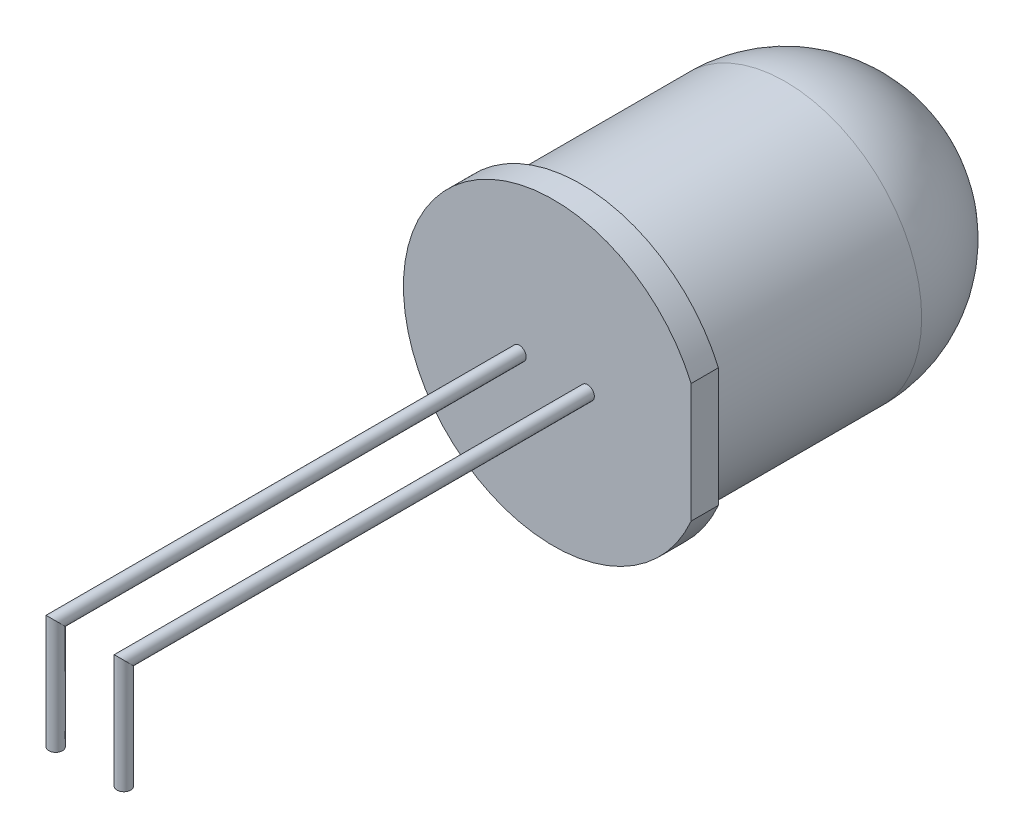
from build123d import *

# Parameters (mm, degrees)
ESQUISSE1_R          = 5
BASE_EXTRUSION_DEPTH = 13.5
BOSS_EXTRU_1_DEPTH   = 1
CONG_1_R             = 5
ESQUISSE3_R          = 0.25


with BuildPart() as part:
    # Esquisse1 → Base-Extrusion (new body)
    with BuildSketch(Plane.XY):
        Circle(ESQUISSE1_R)
    extrude(amount=BASE_EXTRUSION_DEPTH)

    # Esquisse2 → Boss.-Extru.1 (add)
    with BuildSketch(Plane.XY.offset(13.5)):
        with BuildLine():
            Line((5.047640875, 2.184335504), (5.047640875, -2.184335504))
            ThreePointArc((5.047640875, -2.184335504), (-5.5, 0), (5.047640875, 2.184335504))
        make_face()
    extrude(amount=-BOSS_EXTRU_1_DEPTH)

    # Cong_1
    cong_1_edges = [part.edges().sort_by_distance(p)[0] for p in [
        (-5, 0, 0),
    ]]
    fillet(cong_1_edges, radius=CONG_1_R)

    # Balayage1: sweep along a path in Esquisse4
    with BuildLine(Plane(origin=(-1.25, 0, 0), x_dir=(0, 0, -1), z_dir=(1, 0, 0))) as balayage1_path:
        Line((-13.5, 0), (-30.5, 0))
        Line((-30.5, 0), (-30.5, -4))
    # Esquisse3 → Balayage1 (sweep)
    with BuildSketch(Plane.XY.offset(13.5)):
        with Locations((-1.25, 0)):
            Circle(ESQUISSE3_R)
    balayage1 = sweep(path=balayage1_path.line, transition=Transition.RIGHT)

    # Sym_trie1: Balayage1 across plane
    add(balayage1.mirror(Plane(origin=(0, 0, 0), x_dir=(0, 0, 1), z_dir=(1, 0, 0))))


solid = part.part
